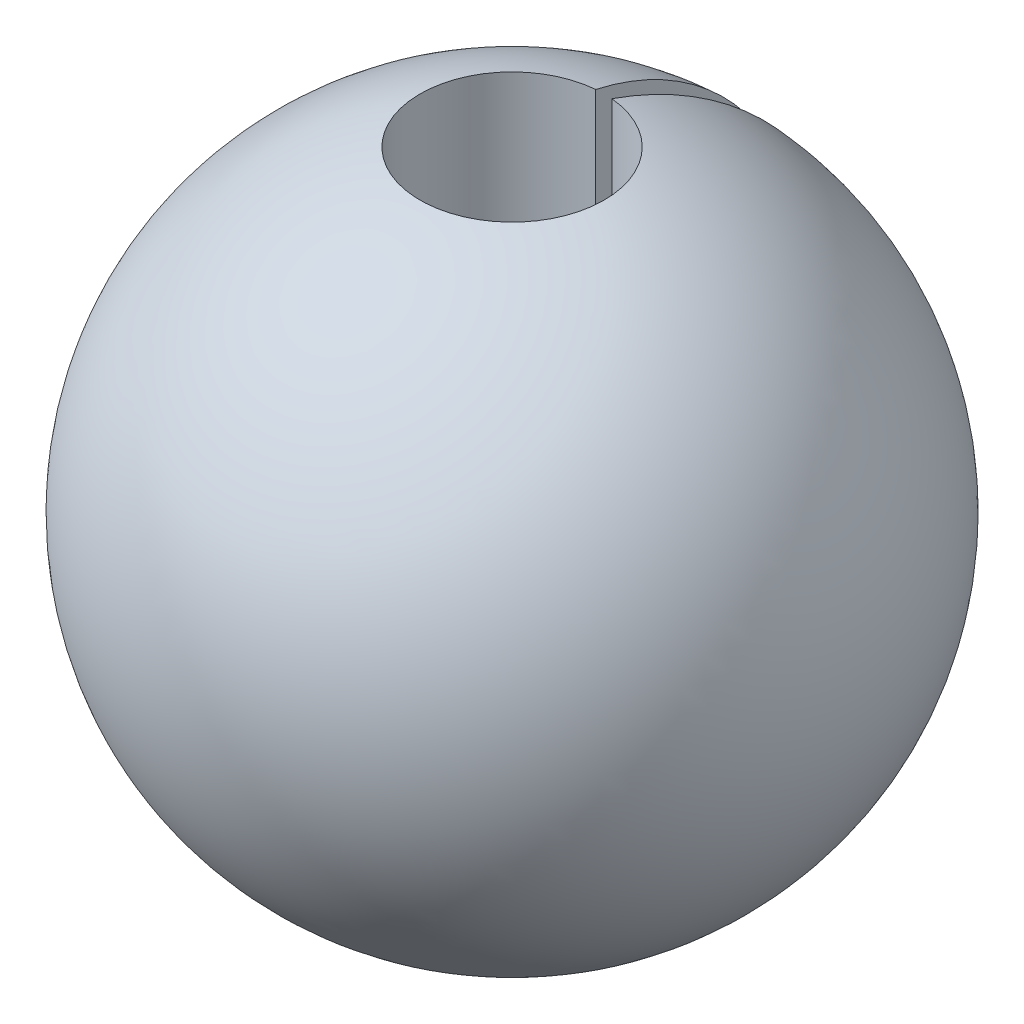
ISO-10303-21;
HEADER;
FILE_DESCRIPTION(('STEP AP214'),'2;1');
FILE_NAME('part.step','',(''),(''),'','','');
FILE_SCHEMA(('AUTOMOTIVE_DESIGN { 1 0 10303 214 1 1 1 1 }'));
ENDSEC;
DATA;
#1=APPLICATION_CONTEXT('core data for automotive mechanical design processes');
#2=APPLICATION_PROTOCOL_DEFINITION('international standard','automotive_design',2000,#1);
#3=PRODUCT_CONTEXT('',#1,'mechanical');
#4=PRODUCT('Part','Part','',(#3));
#5=PRODUCT_RELATED_PRODUCT_CATEGORY('part','',(#4));
#6=PRODUCT_DEFINITION_FORMATION('','',#4);
#7=PRODUCT_DEFINITION_CONTEXT('part definition',#1,'design');
#8=PRODUCT_DEFINITION('design','',#6,#7);
#9=PRODUCT_DEFINITION_SHAPE('','',#8);
#10=(LENGTH_UNIT() NAMED_UNIT(*) SI_UNIT(.MILLI.,.METRE.));
#11=(NAMED_UNIT(*) PLANE_ANGLE_UNIT() SI_UNIT($,.RADIAN.));
#12=(NAMED_UNIT(*) SI_UNIT($,.STERADIAN.) SOLID_ANGLE_UNIT());
#13=UNCERTAINTY_MEASURE_WITH_UNIT(LENGTH_MEASURE(1.E-05),#10,'distance_accuracy_value','');
#14=(GEOMETRIC_REPRESENTATION_CONTEXT(3) GLOBAL_UNCERTAINTY_ASSIGNED_CONTEXT((#13)) GLOBAL_UNIT_ASSIGNED_CONTEXT((#10,
#11,#12)) REPRESENTATION_CONTEXT('',''));
#15=CARTESIAN_POINT('',(0.,0.,0.));
#16=DIRECTION('',(0.,0.,1.));
#17=DIRECTION('',(1.,0.,0.));
#18=AXIS2_PLACEMENT_3D('',#15,#16,#17);
#19=CARTESIAN_POINT('',(0.,178.268064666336,0.));
#20=DIRECTION('',(0.,1.,0.));
#21=DIRECTION('',(0.,0.,1.));
#22=AXIS2_PLACEMENT_3D('',#19,#20,#21);
#23=DEGENERATE_TOROIDAL_SURFACE('',#22,1.75031425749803,1076.,.T.);
#24=CARTESIAN_POINT('',(0.,-855.281946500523,0.));
#25=DIRECTION('',(0.,1.,0.));
#26=DIRECTION('',(0.,0.,1.));
#27=AXIS2_PLACEMENT_3D('',#24,#25,#26);
#28=CIRCLE('',#27,301.);
#29=CARTESIAN_POINT('',(-26.2338785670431,-855.281946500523,-299.854604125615));
#30=VERTEX_POINT('',#29);
#31=CARTESIAN_POINT('',(26.2338785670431,-855.281946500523,-299.854604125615));
#32=VERTEX_POINT('',#31);
#33=EDGE_CURVE('E11',#30,#32,#28,.T.);
#34=ORIENTED_EDGE('',*,*,#33,.T.);
#35=CARTESIAN_POINT('',(0.152549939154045,178.268064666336,-1.74365378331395));
#36=DIRECTION('',(-0.996194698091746,0.,-0.0871557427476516));
#37=DIRECTION('',(-0.0871557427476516,0.,0.996194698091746));
#38=AXIS2_PLACEMENT_3D('',#35,#36,#37);
#39=CIRCLE('',#38,1076.);
#40=CARTESIAN_POINT('',(26.2338785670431,1211.81807583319,-299.854604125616));
#41=VERTEX_POINT('',#40);
#42=EDGE_CURVE('E61',#41,#32,#39,.T.);
#43=ORIENTED_EDGE('',*,*,#42,.F.);
#44=CARTESIAN_POINT('',(0.,1211.81807583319,-1.3894255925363E-13));
#45=DIRECTION('',(0.,1.,0.));
#46=DIRECTION('',(0.,0.,1.));
#47=AXIS2_PLACEMENT_3D('',#44,#45,#46);
#48=CIRCLE('',#47,301.);
#49=CARTESIAN_POINT('',(-26.2338785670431,1211.81807583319,-299.854604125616));
#50=VERTEX_POINT('',#49);
#51=EDGE_CURVE('E44',#50,#41,#48,.T.);
#52=ORIENTED_EDGE('',*,*,#51,.F.);
#53=CARTESIAN_POINT('',(-0.152549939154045,178.268064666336,-1.74365378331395));
#54=DIRECTION('',(-0.996194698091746,0.,0.0871557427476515));
#55=DIRECTION('',(0.0871557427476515,0.,0.996194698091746));
#56=AXIS2_PLACEMENT_3D('',#53,#54,#55);
#57=CIRCLE('',#56,1076.);
#58=EDGE_CURVE('E63',#50,#30,#57,.T.);
#59=ORIENTED_EDGE('',*,*,#58,.T.);
#60=EDGE_LOOP('',(#34,#43,#52,#59));
#61=FACE_BOUND('',#60,.T.);
#62=ADVANCED_FACE('F36',(#61),#23,.T.);
#63=CARTESIAN_POINT('',(0.,241.2,0.));
#64=DIRECTION('',(0.,1.,0.));
#65=DIRECTION('',(0.,0.,1.));
#66=AXIS2_PLACEMENT_3D('',#63,#64,#65);
#67=CYLINDRICAL_SURFACE('',#66,301.);
#68=DIRECTION('',(0.,1.,0.));
#69=VECTOR('',#68,1.);
#70=CARTESIAN_POINT('',(-26.2338785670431,-855.281946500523,-299.854604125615));
#71=LINE('',#70,#69);
#72=EDGE_CURVE('E70',#30,#50,#71,.T.);
#73=ORIENTED_EDGE('',*,*,#72,.T.);
#74=ORIENTED_EDGE('',*,*,#51,.T.);
#75=DIRECTION('',(0.,1.,0.));
#76=VECTOR('',#75,1.);
#77=CARTESIAN_POINT('',(26.2338785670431,-855.281946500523,-299.854604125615));
#78=LINE('',#77,#76);
#79=EDGE_CURVE('E67',#32,#41,#78,.T.);
#80=ORIENTED_EDGE('',*,*,#79,.F.);
#81=ORIENTED_EDGE('',*,*,#33,.F.);
#82=EDGE_LOOP('',(#73,#74,#80,#81));
#83=FACE_BOUND('',#82,.T.);
#84=ADVANCED_FACE('F38',(#83),#67,.F.);
#85=CARTESIAN_POINT('',(-0.152549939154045,178.268064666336,-1.74365378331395));
#86=DIRECTION('',(-0.996194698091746,0.,0.0871557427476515));
#87=DIRECTION('',(0.0871557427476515,0.,0.996194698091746));
#88=AXIS2_PLACEMENT_3D('',#85,#86,#87);
#89=PLANE('',#88);
#90=ORIENTED_EDGE('',*,*,#58,.F.);
#91=ORIENTED_EDGE('',*,*,#72,.F.);
#92=EDGE_LOOP('',(#90,#91));
#93=FACE_BOUND('',#92,.T.);
#94=ADVANCED_FACE('F74',(#93),#89,.F.);
#95=CARTESIAN_POINT('',(0.152549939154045,178.268064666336,-1.74365378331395));
#96=DIRECTION('',(-0.996194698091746,0.,-0.0871557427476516));
#97=DIRECTION('',(-0.0871557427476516,0.,0.996194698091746));
#98=AXIS2_PLACEMENT_3D('',#95,#96,#97);
#99=PLANE('',#98);
#100=ORIENTED_EDGE('',*,*,#42,.T.);
#101=ORIENTED_EDGE('',*,*,#79,.T.);
#102=EDGE_LOOP('',(#100,#101));
#103=FACE_BOUND('',#102,.T.);
#104=ADVANCED_FACE('F66',(#103),#99,.T.);
#105=CLOSED_SHELL('',(#62,#84,#94,#104));
#106=MANIFOLD_SOLID_BREP('B2',#105);
#107=ADVANCED_BREP_SHAPE_REPRESENTATION('',(#18,#106),#14);
#108=SHAPE_DEFINITION_REPRESENTATION(#9,#107);
ENDSEC;
END-ISO-10303-21;
